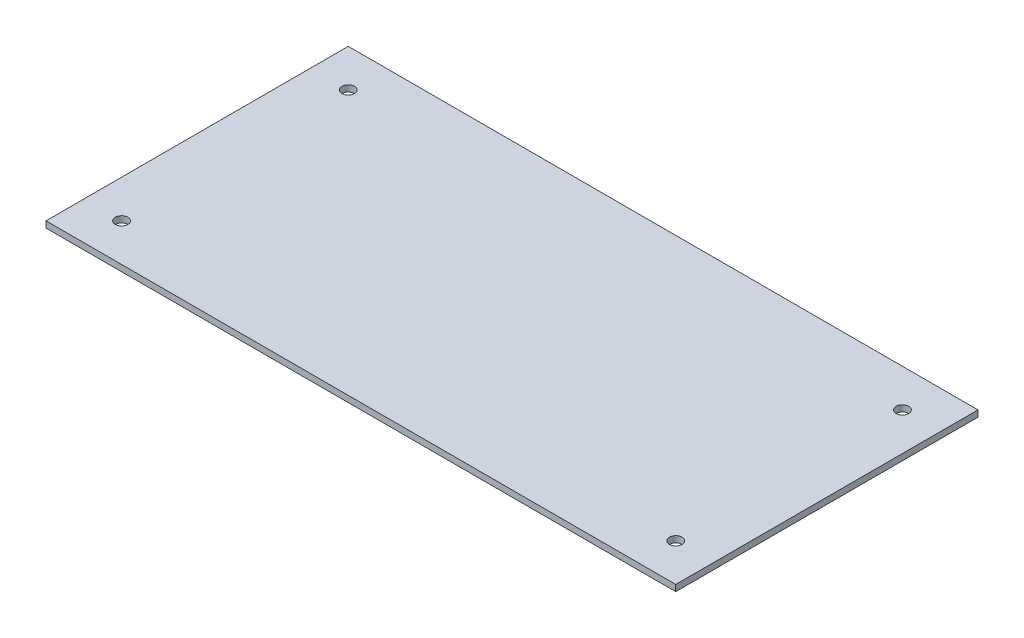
from build123d import *

# Parameters (mm, degrees)
SKETCH1_W               = 2540
SKETCH1_H               = 1219.2
EXTRUDE1_DEPTH          = 25.4
SKETCH2_R               = 25.4
CUT_EXTRUDE1_DEPTH      = 1409.956110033
MIRROR2_COPY_1_SKETCH_R = 25.4
MIRROR2_COPY_1_DEPTH    = 1409.956110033


with BuildPart() as part:
    # Sketch1 → Extrude1 (new body)
    with BuildSketch(Plane(origin=(0, 0, 0), x_dir=(1, 0, 0), z_dir=(0, 1, 0))):
        Rectangle(SKETCH1_W, SKETCH1_H)
    extrude(amount=EXTRUDE1_DEPTH)

    # Sketch2 → Cut-Extrude1 (cut, through all)
    with BuildSketch(Plane(origin=(0, 25.4, 0), x_dir=(1, 0, 0), z_dir=(0, 1, 0))):
        with Locations(Location((-1117.6, 457.2, 0), (0, 0, 270))):
            Circle(SKETCH2_R)
    cut_extrude1 = extrude(amount=-CUT_EXTRUDE1_DEPTH, mode=Mode.SUBTRACT)

    # Mirror1: Cut-Extrude1 across plane
    add(cut_extrude1.mirror(Plane.XY), mode=Mode.SUBTRACT)

    # Mirror2: Cut-Extrude1 across plane
    add(cut_extrude1.mirror(Plane(origin=(0, 0, 0), x_dir=(0, 0, 1), z_dir=(1, 0, 0))), mode=Mode.SUBTRACT)

    # Mirror2 copy 1 sketch → Mirror2 copy 1 (cut, through all)
    with BuildSketch(Plane(origin=(0, 25.4, 0), x_dir=(-1, 0, 0), z_dir=(0, 1, 0))):
        with Locations(Location((-1117.6, 457.2, 0), (0, 0, 270))):
            Circle(MIRROR2_COPY_1_SKETCH_R)
    extrude(amount=-MIRROR2_COPY_1_DEPTH, mode=Mode.SUBTRACT)


solid = part.part
